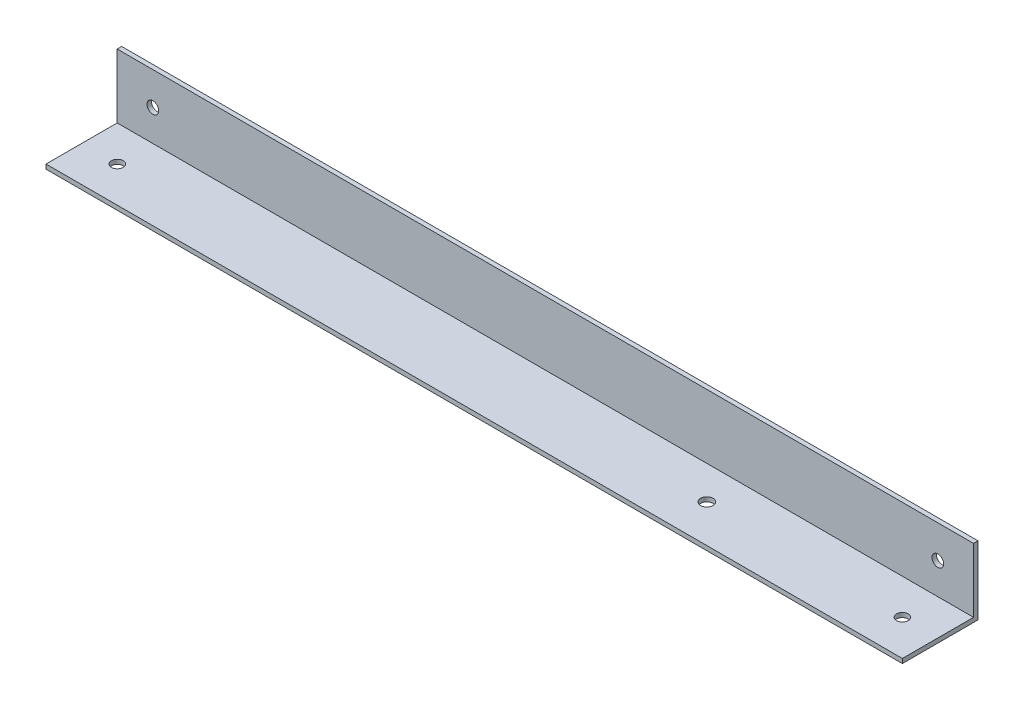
from build123d import *

# Parameters (mm, degrees)
SKETCH1_W           = 304.8
SKETCH1_H           = 24.384
BOSS_EXTRUDE1_DEPTH = 26.924
SKETCH2_W           = 304.8
SKETCH2_H           = 25.3365
CUT_EXTRUDE1_DEPTH  = 12.7
SKETCH3_W           = 304.8
SKETCH3_H           = 10.0965
CUT_EXTRUDE3_DEPTH  = 25.3365
SKETCH4_R           = 2.0828
CUT_EXTRUDE4_DEPTH  = 2.54
SKETCH5_R           = 2.0828
CUT_EXTRUDE5_DEPTH  = 2.54
SKETCH7_R           = 2.2349968
CUT_EXTRUDE6_DEPTH  = 2.54


with BuildPart() as part:
    # Sketch1 → Boss-Extrude1 (new body)
    with BuildSketch(Plane.XY):
        with Locations((-57.426086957, 55.646509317)):
            Rectangle(SKETCH1_W, SKETCH1_H)
    extrude(amount=BOSS_EXTRUDE1_DEPTH)

    # Sketch2 → Cut-Extrude1 (cut)
    with BuildSketch(Plane(origin=(0, 67.838509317, 0), x_dir=(1, 0, 0), z_dir=(0, 1, 0))):
        with Locations((-57.426086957, -14.25575)):
            Rectangle(SKETCH2_W, SKETCH2_H)
    extrude(amount=-CUT_EXTRUDE1_DEPTH, mode=Mode.SUBTRACT)

    # Sketch3 → Cut-Extrude3 (cut)
    with BuildSketch(Plane.XY.offset(26.924)):
        with Locations((-57.426086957, 50.090259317)):
            Rectangle(SKETCH3_W, SKETCH3_H)
    extrude(amount=-CUT_EXTRUDE3_DEPTH, mode=Mode.SUBTRACT)

    # Sketch4 → Cut-Extrude4 (cut)
    with BuildSketch(Plane(origin=(0, 0, 0), x_dir=(-1, 0, 0), z_dir=(0, 0, -1))):
        with Locations((-82.273913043, 56.154509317)):
            Circle(SKETCH4_R)
        with Locations((197.126086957, 56.154509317)):
            Circle(SKETCH4_R)
    extrude(amount=-CUT_EXTRUDE4_DEPTH, mode=Mode.SUBTRACT)

    # Sketch5 → Cut-Extrude5 (cut)
    with BuildSketch(Plane.XZ.offset(-43.454509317)):
        with Locations(Location((-197.126086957, 14.224, 0), (0, 0, 270))):
            Circle(SKETCH5_R)
        with Locations(Location((82.273913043, 14.224, 0), (0, 0, 270))):
            Circle(SKETCH5_R)
    extrude(amount=-CUT_EXTRUDE5_DEPTH, mode=Mode.SUBTRACT)

    # Sketch7 → Cut-Extrude6 (cut)
    with BuildSketch(Plane.XZ.offset(-43.454509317)):
        with Locations(Location((11.915913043, 13.462, 0), (0, 0, 270))):
            Circle(SKETCH7_R)
    extrude(amount=-CUT_EXTRUDE6_DEPTH, mode=Mode.SUBTRACT)


solid = part.part
